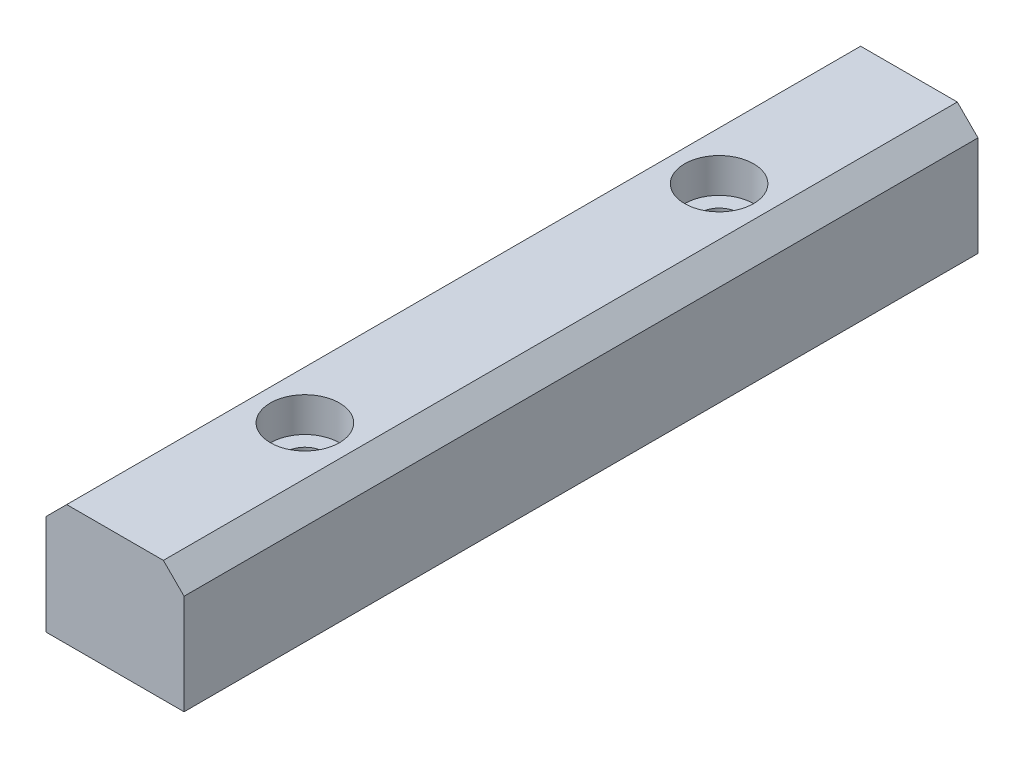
from build123d import *

# Parameters (mm, degrees)
SKIZZE1_W                                            = 20
SKIZZE1_H                                            = 115
LINEAR_AUSTRAGEN1_DEPTH                              = 17.5
STIRNSENKUNG_F_R_M5_ZYLINDERSCHRAUBE_MIT_D           = 5.5
STIRNSENKUNG_F_R_M5_ZYLINDERSCHRAUBE_MIT_CBORE_D     = 10
STIRNSENKUNG_F_R_M5_ZYLINDERSCHRAUBE_MIT_CBORE_DEPTH = 5
FASE1_SIZE                                           = 3


with BuildPart() as part:
    # Skizze1 → Linear austragen1 (new body)
    with BuildSketch(Plane(origin=(0, 0, 0), x_dir=(1, 0, 0), z_dir=(0, 1, 0))):
        Rectangle(SKIZZE1_W, SKIZZE1_H)
    extrude(amount=LINEAR_AUSTRAGEN1_DEPTH)

    # Stirnsenkung f_r M5 Zylinderschraube mit (through all)
    with Locations(Plane(origin=(0, 17.5, 0), x_dir=(-1, 0, 0), z_dir=(0, 1, 0))):
        with Locations((0, 30), (0, -30)):
            CounterBoreHole(STIRNSENKUNG_F_R_M5_ZYLINDERSCHRAUBE_MIT_D / 2, STIRNSENKUNG_F_R_M5_ZYLINDERSCHRAUBE_MIT_CBORE_D / 2, STIRNSENKUNG_F_R_M5_ZYLINDERSCHRAUBE_MIT_CBORE_DEPTH)

    # Fase1
    fase1_edges = [part.edges().sort_by_distance(p)[0] for p in [
        (10, 17.5, 0),
        (-10, 17.5, 0),
    ]]
    chamfer(fase1_edges, length=FASE1_SIZE)


solid = part.part
